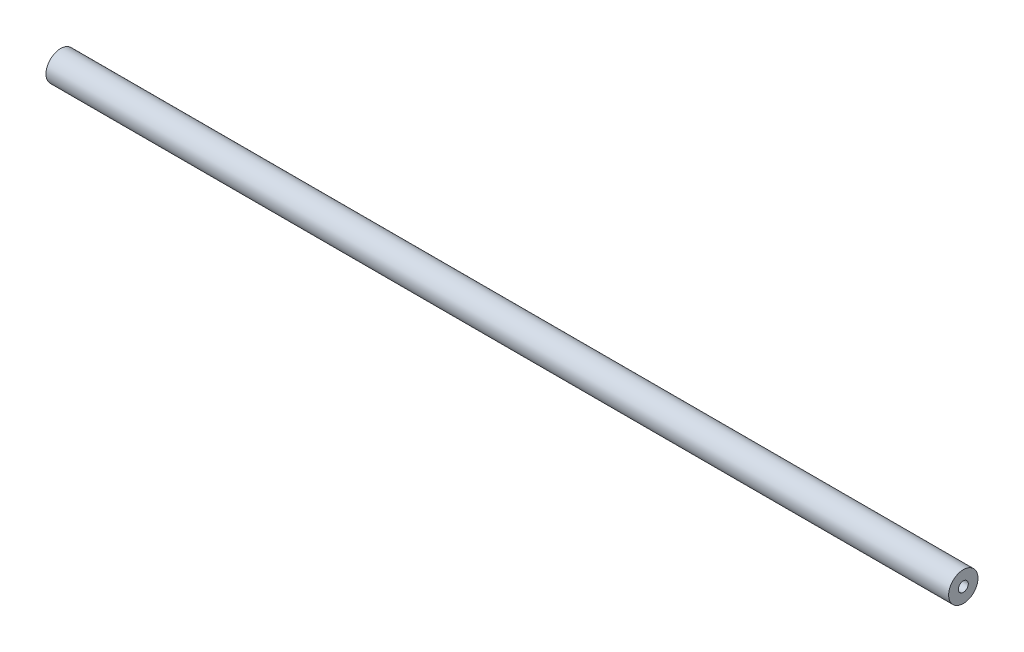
from build123d import *

# Parameters (mm, degrees)
ESQUISSE1_R                = 10
EXTRUSION1_DEPTH           = 307.5
TROU_TARAUD_M8X1_251_D     = 6.8
TROU_TARAUD_M8X1_251_DEPTH = 20
TROU_TARAUD_M8X1_251_TIP   = 2.042926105
TROU_TARAUD_M8X1_252_D     = 6.8
TROU_TARAUD_M8X1_252_DEPTH = 20
TROU_TARAUD_M8X1_252_TIP   = 2.042926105


with BuildPart() as part:
    # Esquisse1 → Extrusion1 (new, symmetric)
    with BuildSketch(Plane(origin=(0, 0, 0), x_dir=(0, 0, -1), z_dir=(1, 0, 0))):
        Circle(ESQUISSE1_R)
    extrude(amount=EXTRUSION1_DEPTH, both=True)

    # Trou taraud_ M8x1.251
    with Locations(Plane(origin=(307.5, 0, 0), x_dir=(0, 0, -1), z_dir=(1, 0, 0))):
        with Locations((0, 0)):
            Hole(TROU_TARAUD_M8X1_251_D / 2, depth=TROU_TARAUD_M8X1_251_DEPTH)
            with Locations((0, 0, -(TROU_TARAUD_M8X1_251_DEPTH + TROU_TARAUD_M8X1_251_TIP / 2))):  # 118° drill point
                Cone(0, TROU_TARAUD_M8X1_251_D / 2, TROU_TARAUD_M8X1_251_TIP, mode=Mode.SUBTRACT)

    # Trou taraud_ M8x1.252
    with Locations(Plane.ZY.offset(307.5)):
        with Locations((0, 0)):
            Hole(TROU_TARAUD_M8X1_252_D / 2, depth=TROU_TARAUD_M8X1_252_DEPTH)
            with Locations((0, 0, -(TROU_TARAUD_M8X1_252_DEPTH + TROU_TARAUD_M8X1_252_TIP / 2))):  # 118° drill point
                Cone(0, TROU_TARAUD_M8X1_252_D / 2, TROU_TARAUD_M8X1_252_TIP, mode=Mode.SUBTRACT)


solid = part.part
